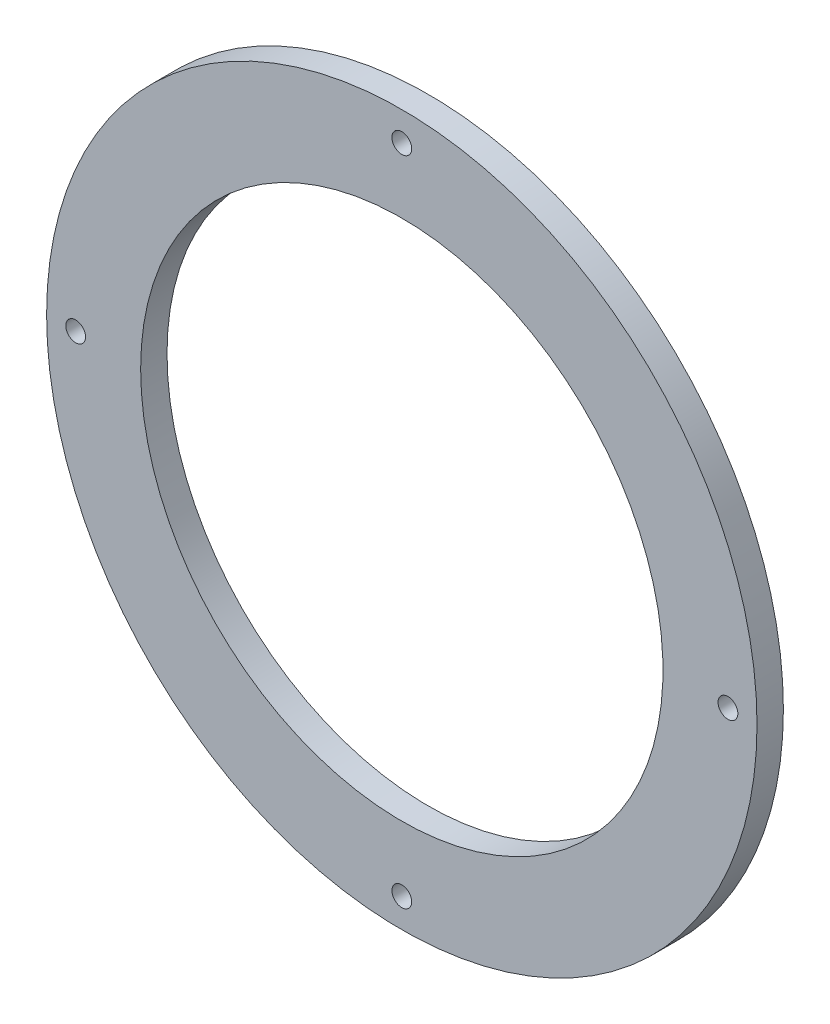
ISO-10303-21;
HEADER;
FILE_DESCRIPTION(('STEP AP214'),'2;1');
FILE_NAME('part.step','',(''),(''),'','','');
FILE_SCHEMA(('AUTOMOTIVE_DESIGN { 1 0 10303 214 1 1 1 1 }'));
ENDSEC;
DATA;
#1=APPLICATION_CONTEXT('core data for automotive mechanical design processes');
#2=APPLICATION_PROTOCOL_DEFINITION('international standard','automotive_design',2000,#1);
#3=PRODUCT_CONTEXT('',#1,'mechanical');
#4=PRODUCT('Part','Part','',(#3));
#5=PRODUCT_RELATED_PRODUCT_CATEGORY('part','',(#4));
#6=PRODUCT_DEFINITION_FORMATION('','',#4);
#7=PRODUCT_DEFINITION_CONTEXT('part definition',#1,'design');
#8=PRODUCT_DEFINITION('design','',#6,#7);
#9=PRODUCT_DEFINITION_SHAPE('','',#8);
#10=(LENGTH_UNIT() NAMED_UNIT(*) SI_UNIT(.MILLI.,.METRE.));
#11=(NAMED_UNIT(*) PLANE_ANGLE_UNIT() SI_UNIT($,.RADIAN.));
#12=(NAMED_UNIT(*) SI_UNIT($,.STERADIAN.) SOLID_ANGLE_UNIT());
#13=UNCERTAINTY_MEASURE_WITH_UNIT(LENGTH_MEASURE(1.E-05),#10,'distance_accuracy_value','');
#14=(GEOMETRIC_REPRESENTATION_CONTEXT(3) GLOBAL_UNCERTAINTY_ASSIGNED_CONTEXT((#13)) GLOBAL_UNIT_ASSIGNED_CONTEXT((#10,
#11,#12)) REPRESENTATION_CONTEXT('',''));
#15=CARTESIAN_POINT('',(0.,0.,0.));
#16=DIRECTION('',(0.,0.,1.));
#17=DIRECTION('',(1.,0.,0.));
#18=AXIS2_PLACEMENT_3D('',#15,#16,#17);
#19=CARTESIAN_POINT('',(0.,0.,6.35));
#20=DIRECTION('',(0.,0.,1.));
#21=DIRECTION('',(1.,0.,0.));
#22=AXIS2_PLACEMENT_3D('',#19,#20,#21);
#23=PLANE('',#22);
#24=CARTESIAN_POINT('',(0.,0.,6.35));
#25=DIRECTION('',(0.,0.,-1.));
#26=DIRECTION('',(-1.,0.,0.));
#27=AXIS2_PLACEMENT_3D('',#24,#25,#26);
#28=CIRCLE('',#27,62.865);
#29=CARTESIAN_POINT('',(-62.865,0.,6.35));
#30=VERTEX_POINT('',#29);
#31=EDGE_CURVE('E106',#30,#30,#28,.T.);
#32=ORIENTED_EDGE('',*,*,#31,.T.);
#33=EDGE_LOOP('',(#32));
#34=FACE_BOUND('',#33,.T.);
#35=CARTESIAN_POINT('',(2.80000286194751E-08,-78.5,6.35));
#36=DIRECTION('',(0.,0.,1.));
#37=DIRECTION('',(1.,0.,0.));
#38=AXIS2_PLACEMENT_3D('',#35,#36,#37);
#39=CIRCLE('',#38,2.38125000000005);
#40=CARTESIAN_POINT('',(2.38125002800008,-78.5,6.35));
#41=VERTEX_POINT('',#40);
#42=EDGE_CURVE('E90',#41,#41,#39,.T.);
#43=ORIENTED_EDGE('',*,*,#42,.F.);
#44=EDGE_LOOP('',(#43));
#45=FACE_BOUND('',#44,.T.);
#46=CARTESIAN_POINT('',(2.34568847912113E-13,78.499999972,6.35));
#47=DIRECTION('',(0.,0.,1.));
#48=DIRECTION('',(1.,0.,0.));
#49=AXIS2_PLACEMENT_3D('',#46,#47,#48);
#50=CIRCLE('',#49,2.38125000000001);
#51=CARTESIAN_POINT('',(2.38125000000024,78.499999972,6.35));
#52=VERTEX_POINT('',#51);
#53=EDGE_CURVE('E76',#52,#52,#50,.T.);
#54=ORIENTED_EDGE('',*,*,#53,.F.);
#55=EDGE_LOOP('',(#54));
#56=FACE_BOUND('',#55,.T.);
#57=CARTESIAN_POINT('',(0.,0.,6.35));
#58=DIRECTION('',(0.,0.,1.));
#59=DIRECTION('',(1.,0.,0.));
#60=AXIS2_PLACEMENT_3D('',#57,#58,#59);
#61=CIRCLE('',#60,85.5);
#62=CARTESIAN_POINT('',(85.5,0.,6.35));
#63=VERTEX_POINT('',#62);
#64=EDGE_CURVE('E11',#63,#63,#61,.T.);
#65=ORIENTED_EDGE('',*,*,#64,.T.);
#66=EDGE_LOOP('',(#65));
#67=FACE_BOUND('',#66,.T.);
#68=CARTESIAN_POINT('',(78.5,0.,6.35));
#69=DIRECTION('',(0.,0.,1.));
#70=DIRECTION('',(1.,0.,0.));
#71=AXIS2_PLACEMENT_3D('',#68,#69,#70);
#72=CIRCLE('',#71,2.38125000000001);
#73=CARTESIAN_POINT('',(80.88125,0.,6.35));
#74=VERTEX_POINT('',#73);
#75=EDGE_CURVE('E82',#74,#74,#72,.T.);
#76=ORIENTED_EDGE('',*,*,#75,.F.);
#77=EDGE_LOOP('',(#76));
#78=FACE_BOUND('',#77,.T.);
#79=CARTESIAN_POINT('',(-78.499999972,-2.80000326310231E-08,6.35));
#80=DIRECTION('',(0.,0.,1.));
#81=DIRECTION('',(1.,0.,0.));
#82=AXIS2_PLACEMENT_3D('',#79,#80,#81);
#83=CIRCLE('',#82,2.38125000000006);
#84=CARTESIAN_POINT('',(-76.1187499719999,-2.80000326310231E-08,6.35));
#85=VERTEX_POINT('',#84);
#86=EDGE_CURVE('E98',#85,#85,#83,.T.);
#87=ORIENTED_EDGE('',*,*,#86,.F.);
#88=EDGE_LOOP('',(#87));
#89=FACE_BOUND('',#88,.T.);
#90=ADVANCED_FACE('F63',(#34,#45,#56,#67,#78,#89),#23,.T.);
#91=CARTESIAN_POINT('',(0.,0.,0.));
#92=DIRECTION('',(0.,0.,1.));
#93=DIRECTION('',(1.,0.,0.));
#94=AXIS2_PLACEMENT_3D('',#91,#92,#93);
#95=PLANE('',#94);
#96=CARTESIAN_POINT('',(0.,0.,0.));
#97=DIRECTION('',(0.,0.,-1.));
#98=DIRECTION('',(-1.,0.,0.));
#99=AXIS2_PLACEMENT_3D('',#96,#97,#98);
#100=CIRCLE('',#99,62.865);
#101=CARTESIAN_POINT('',(-62.865,0.,0.));
#102=VERTEX_POINT('',#101);
#103=EDGE_CURVE('E110',#102,#102,#100,.T.);
#104=ORIENTED_EDGE('',*,*,#103,.F.);
#105=EDGE_LOOP('',(#104));
#106=FACE_BOUND('',#105,.T.);
#107=CARTESIAN_POINT('',(0.,0.,0.));
#108=DIRECTION('',(0.,0.,1.));
#109=DIRECTION('',(1.,0.,0.));
#110=AXIS2_PLACEMENT_3D('',#107,#108,#109);
#111=CIRCLE('',#110,85.5);
#112=CARTESIAN_POINT('',(85.5,0.,0.));
#113=VERTEX_POINT('',#112);
#114=EDGE_CURVE('E67',#113,#113,#111,.T.);
#115=ORIENTED_EDGE('',*,*,#114,.F.);
#116=EDGE_LOOP('',(#115));
#117=FACE_BOUND('',#116,.T.);
#118=CARTESIAN_POINT('',(2.34568847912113E-13,78.499999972,0.));
#119=DIRECTION('',(0.,0.,1.));
#120=DIRECTION('',(1.,0.,0.));
#121=AXIS2_PLACEMENT_3D('',#118,#119,#120);
#122=CIRCLE('',#121,2.38125000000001);
#123=CARTESIAN_POINT('',(2.38125000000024,78.499999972,0.));
#124=VERTEX_POINT('',#123);
#125=EDGE_CURVE('E78',#124,#124,#122,.T.);
#126=ORIENTED_EDGE('',*,*,#125,.T.);
#127=EDGE_LOOP('',(#126));
#128=FACE_BOUND('',#127,.T.);
#129=CARTESIAN_POINT('',(78.5,0.,0.));
#130=DIRECTION('',(0.,0.,1.));
#131=DIRECTION('',(1.,0.,0.));
#132=AXIS2_PLACEMENT_3D('',#129,#130,#131);
#133=CIRCLE('',#132,2.38125000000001);
#134=CARTESIAN_POINT('',(80.88125,0.,0.));
#135=VERTEX_POINT('',#134);
#136=EDGE_CURVE('E86',#135,#135,#133,.T.);
#137=ORIENTED_EDGE('',*,*,#136,.T.);
#138=EDGE_LOOP('',(#137));
#139=FACE_BOUND('',#138,.T.);
#140=CARTESIAN_POINT('',(2.80000286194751E-08,-78.5,0.));
#141=DIRECTION('',(0.,0.,1.));
#142=DIRECTION('',(1.,0.,0.));
#143=AXIS2_PLACEMENT_3D('',#140,#141,#142);
#144=CIRCLE('',#143,2.38125000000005);
#145=CARTESIAN_POINT('',(2.38125002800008,-78.5,0.));
#146=VERTEX_POINT('',#145);
#147=EDGE_CURVE('E94',#146,#146,#144,.T.);
#148=ORIENTED_EDGE('',*,*,#147,.T.);
#149=EDGE_LOOP('',(#148));
#150=FACE_BOUND('',#149,.T.);
#151=CARTESIAN_POINT('',(-78.499999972,-2.80000326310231E-08,0.));
#152=DIRECTION('',(0.,0.,1.));
#153=DIRECTION('',(1.,0.,0.));
#154=AXIS2_PLACEMENT_3D('',#151,#152,#153);
#155=CIRCLE('',#154,2.38125000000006);
#156=CARTESIAN_POINT('',(-76.1187499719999,-2.80000326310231E-08,0.));
#157=VERTEX_POINT('',#156);
#158=EDGE_CURVE('E102',#157,#157,#155,.T.);
#159=ORIENTED_EDGE('',*,*,#158,.T.);
#160=EDGE_LOOP('',(#159));
#161=FACE_BOUND('',#160,.T.);
#162=ADVANCED_FACE('F127',(#106,#117,#128,#139,#150,#161),#95,.F.);
#163=CARTESIAN_POINT('',(0.,0.,6.35));
#164=DIRECTION('',(0.,0.,-1.));
#165=DIRECTION('',(-1.,0.,0.));
#166=AXIS2_PLACEMENT_3D('',#163,#164,#165);
#167=CYLINDRICAL_SURFACE('',#166,85.5);
#168=ORIENTED_EDGE('',*,*,#64,.F.);
#169=EDGE_LOOP('',(#168));
#170=FACE_BOUND('',#169,.T.);
#171=ORIENTED_EDGE('',*,*,#114,.T.);
#172=EDGE_LOOP('',(#171));
#173=FACE_BOUND('',#172,.T.);
#174=ADVANCED_FACE('F65',(#170,#173),#167,.T.);
#175=CARTESIAN_POINT('',(2.34568847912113E-13,78.499999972,6.35));
#176=DIRECTION('',(0.,0.,-1.));
#177=DIRECTION('',(-1.,0.,0.));
#178=AXIS2_PLACEMENT_3D('',#175,#176,#177);
#179=CYLINDRICAL_SURFACE('',#178,2.38125000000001);
#180=ORIENTED_EDGE('',*,*,#53,.T.);
#181=EDGE_LOOP('',(#180));
#182=FACE_BOUND('',#181,.T.);
#183=ORIENTED_EDGE('',*,*,#125,.F.);
#184=EDGE_LOOP('',(#183));
#185=FACE_BOUND('',#184,.T.);
#186=ADVANCED_FACE('F155',(#182,#185),#179,.F.);
#187=CARTESIAN_POINT('',(78.5,0.,6.35));
#188=DIRECTION('',(0.,0.,-1.));
#189=DIRECTION('',(-1.,0.,0.));
#190=AXIS2_PLACEMENT_3D('',#187,#188,#189);
#191=CYLINDRICAL_SURFACE('',#190,2.38125000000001);
#192=ORIENTED_EDGE('',*,*,#75,.T.);
#193=EDGE_LOOP('',(#192));
#194=FACE_BOUND('',#193,.T.);
#195=ORIENTED_EDGE('',*,*,#136,.F.);
#196=EDGE_LOOP('',(#195));
#197=FACE_BOUND('',#196,.T.);
#198=ADVANCED_FACE('F147',(#194,#197),#191,.F.);
#199=CARTESIAN_POINT('',(2.80000286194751E-08,-78.5,6.35));
#200=DIRECTION('',(0.,0.,-1.));
#201=DIRECTION('',(-1.,0.,0.));
#202=AXIS2_PLACEMENT_3D('',#199,#200,#201);
#203=CYLINDRICAL_SURFACE('',#202,2.38125000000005);
#204=ORIENTED_EDGE('',*,*,#42,.T.);
#205=EDGE_LOOP('',(#204));
#206=FACE_BOUND('',#205,.T.);
#207=ORIENTED_EDGE('',*,*,#147,.F.);
#208=EDGE_LOOP('',(#207));
#209=FACE_BOUND('',#208,.T.);
#210=ADVANCED_FACE('F141',(#206,#209),#203,.F.);
#211=CARTESIAN_POINT('',(-78.499999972,-2.80000326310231E-08,6.35));
#212=DIRECTION('',(0.,0.,-1.));
#213=DIRECTION('',(-1.,0.,0.));
#214=AXIS2_PLACEMENT_3D('',#211,#212,#213);
#215=CYLINDRICAL_SURFACE('',#214,2.38125000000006);
#216=ORIENTED_EDGE('',*,*,#86,.T.);
#217=EDGE_LOOP('',(#216));
#218=FACE_BOUND('',#217,.T.);
#219=ORIENTED_EDGE('',*,*,#158,.F.);
#220=EDGE_LOOP('',(#219));
#221=FACE_BOUND('',#220,.T.);
#222=ADVANCED_FACE('F123',(#218,#221),#215,.F.);
#223=CARTESIAN_POINT('',(0.,0.,6.35));
#224=DIRECTION('',(0.,0.,-1.));
#225=DIRECTION('',(-1.,0.,0.));
#226=AXIS2_PLACEMENT_3D('',#223,#224,#225);
#227=CYLINDRICAL_SURFACE('',#226,62.865);
#228=ORIENTED_EDGE('',*,*,#31,.F.);
#229=EDGE_LOOP('',(#228));
#230=FACE_BOUND('',#229,.T.);
#231=ORIENTED_EDGE('',*,*,#103,.T.);
#232=EDGE_LOOP('',(#231));
#233=FACE_BOUND('',#232,.T.);
#234=ADVANCED_FACE('F120',(#230,#233),#227,.F.);
#235=CLOSED_SHELL('',(#90,#162,#174,#186,#198,#210,#222,#234));
#236=MANIFOLD_SOLID_BREP('B2',#235);
#237=ADVANCED_BREP_SHAPE_REPRESENTATION('',(#18,#236),#14);
#238=SHAPE_DEFINITION_REPRESENTATION(#9,#237);
ENDSEC;
END-ISO-10303-21;
